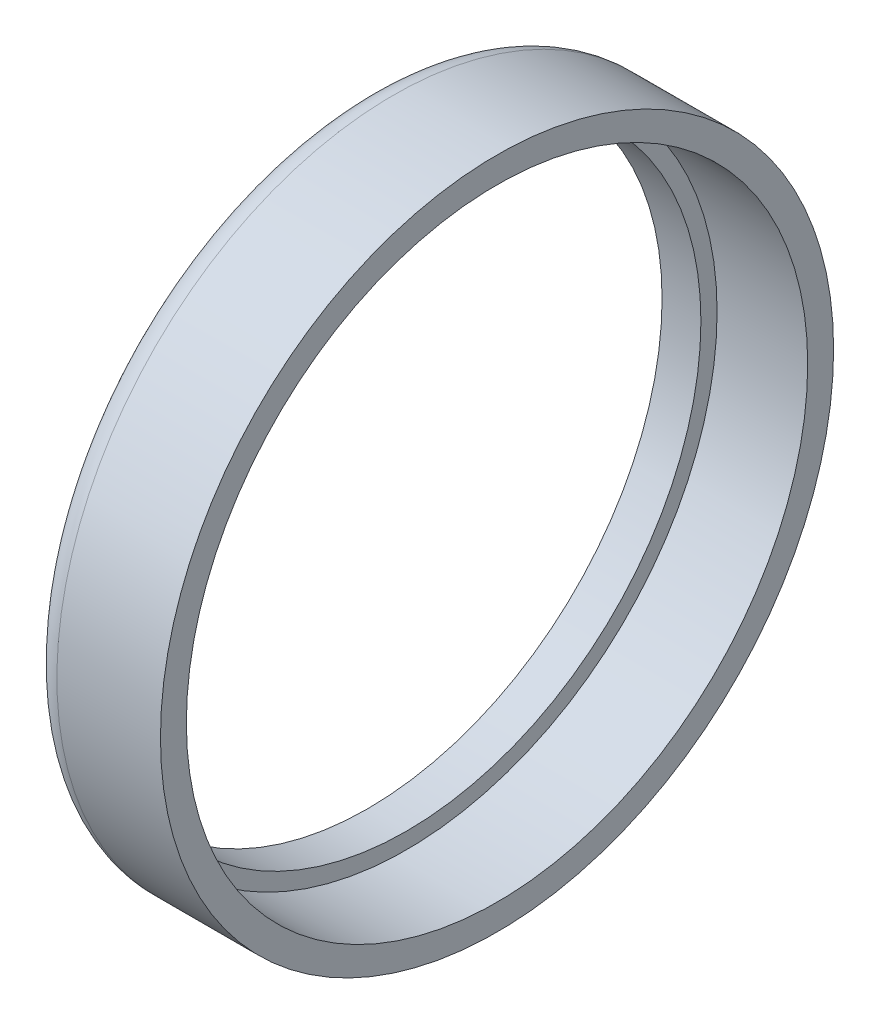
ISO-10303-21;
HEADER;
FILE_DESCRIPTION(('STEP AP214'),'2;1');
FILE_NAME('part.step','',(''),(''),'','','');
FILE_SCHEMA(('AUTOMOTIVE_DESIGN { 1 0 10303 214 1 1 1 1 }'));
ENDSEC;
DATA;
#1=APPLICATION_CONTEXT('core data for automotive mechanical design processes');
#2=APPLICATION_PROTOCOL_DEFINITION('international standard','automotive_design',2000,#1);
#3=PRODUCT_CONTEXT('',#1,'mechanical');
#4=PRODUCT('Part','Part','',(#3));
#5=PRODUCT_RELATED_PRODUCT_CATEGORY('part','',(#4));
#6=PRODUCT_DEFINITION_FORMATION('','',#4);
#7=PRODUCT_DEFINITION_CONTEXT('part definition',#1,'design');
#8=PRODUCT_DEFINITION('design','',#6,#7);
#9=PRODUCT_DEFINITION_SHAPE('','',#8);
#10=(LENGTH_UNIT() NAMED_UNIT(*) SI_UNIT(.MILLI.,.METRE.));
#11=(NAMED_UNIT(*) PLANE_ANGLE_UNIT() SI_UNIT($,.RADIAN.));
#12=(NAMED_UNIT(*) SI_UNIT($,.STERADIAN.) SOLID_ANGLE_UNIT());
#13=UNCERTAINTY_MEASURE_WITH_UNIT(LENGTH_MEASURE(1.E-05),#10,'distance_accuracy_value','');
#14=(GEOMETRIC_REPRESENTATION_CONTEXT(3) GLOBAL_UNCERTAINTY_ASSIGNED_CONTEXT((#13)) GLOBAL_UNIT_ASSIGNED_CONTEXT((#10,
#11,#12)) REPRESENTATION_CONTEXT('',''));
#15=CARTESIAN_POINT('',(0.,0.,0.));
#16=DIRECTION('',(0.,0.,1.));
#17=DIRECTION('',(1.,0.,0.));
#18=AXIS2_PLACEMENT_3D('',#15,#16,#17);
#19=CARTESIAN_POINT('',(-3.00000000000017,0.,0.));
#20=DIRECTION('',(1.,0.,0.));
#21=DIRECTION('',(0.,0.,-1.));
#22=AXIS2_PLACEMENT_3D('',#19,#20,#21);
#23=PLANE('',#22);
#24=CARTESIAN_POINT('',(-3.00000000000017,0.,0.));
#25=DIRECTION('',(1.,0.,0.));
#26=DIRECTION('',(0.,0.,-1.));
#27=AXIS2_PLACEMENT_3D('',#24,#25,#26);
#28=CIRCLE('',#27,22.75);
#29=CARTESIAN_POINT('',(-3.00000000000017,0.,-22.75));
#30=VERTEX_POINT('',#29);
#31=EDGE_CURVE('E38',#30,#30,#28,.T.);
#32=ORIENTED_EDGE('',*,*,#31,.T.);
#33=EDGE_LOOP('',(#32));
#34=FACE_BOUND('',#33,.T.);
#35=CARTESIAN_POINT('',(-3.,0.,0.));
#36=DIRECTION('',(1.,0.,0.));
#37=DIRECTION('',(0.,-1.,0.));
#38=AXIS2_PLACEMENT_3D('',#35,#36,#37);
#39=CIRCLE('',#38,23.99999999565);
#40=CARTESIAN_POINT('',(-3.,-23.99999999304,0.));
#41=VERTEX_POINT('',#40);
#42=CARTESIAN_POINT('',(-3.,23.99999999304,0.));
#43=VERTEX_POINT('',#42);
#44=EDGE_CURVE('E36',#41,#43,#39,.T.);
#45=ORIENTED_EDGE('',*,*,#44,.F.);
#46=CARTESIAN_POINT('',(-3.,0.,0.));
#47=DIRECTION('',(1.,0.,0.));
#48=DIRECTION('',(0.,1.,0.));
#49=AXIS2_PLACEMENT_3D('',#46,#47,#48);
#50=CIRCLE('',#49,23.9999999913);
#51=EDGE_CURVE('E32',#43,#41,#50,.T.);
#52=ORIENTED_EDGE('',*,*,#51,.F.);
#53=EDGE_LOOP('',(#45,#52));
#54=FACE_BOUND('',#53,.T.);
#55=ADVANCED_FACE('F14',(#34,#54),#23,.F.);
#56=CARTESIAN_POINT('',(-3.00000000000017,0.,0.));
#57=DIRECTION('',(1.,0.,0.));
#58=DIRECTION('',(0.,0.,-1.));
#59=AXIS2_PLACEMENT_3D('',#56,#57,#58);
#60=CYLINDRICAL_SURFACE('',#59,22.75);
#61=ORIENTED_EDGE('',*,*,#31,.F.);
#62=EDGE_LOOP('',(#61));
#63=FACE_BOUND('',#62,.T.);
#64=CARTESIAN_POINT('',(0.,0.,0.));
#65=DIRECTION('',(1.,0.,0.));
#66=DIRECTION('',(0.,0.,-1.));
#67=AXIS2_PLACEMENT_3D('',#64,#65,#66);
#68=CIRCLE('',#67,22.75);
#69=CARTESIAN_POINT('',(0.,0.,-22.75));
#70=VERTEX_POINT('',#69);
#71=EDGE_CURVE('E43',#70,#70,#68,.F.);
#72=ORIENTED_EDGE('',*,*,#71,.F.);
#73=EDGE_LOOP('',(#72));
#74=FACE_BOUND('',#73,.T.);
#75=ADVANCED_FACE('F61',(#63,#74),#60,.F.);
#76=CARTESIAN_POINT('',(-1.,0.,0.));
#77=DIRECTION('',(1.,0.,0.));
#78=DIRECTION('',(0.,0.999980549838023,0.00623698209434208));
#79=AXIS2_PLACEMENT_3D('',#76,#77,#78);
#80=TOROIDAL_SURFACE('',#79,24.,2.);
#81=CARTESIAN_POINT('',(-1.,0.,0.));
#82=DIRECTION('',(1.,0.,0.));
#83=DIRECTION('',(0.,-1.,0.));
#84=AXIS2_PLACEMENT_3D('',#81,#82,#83);
#85=CIRCLE('',#84,26.);
#86=CARTESIAN_POINT('',(-1.,-26.,0.));
#87=VERTEX_POINT('',#86);
#88=EDGE_CURVE('E46',#87,#87,#85,.T.);
#89=ORIENTED_EDGE('',*,*,#88,.F.);
#90=EDGE_LOOP('',(#89));
#91=FACE_BOUND('',#90,.T.);
#92=ORIENTED_EDGE('',*,*,#44,.T.);
#93=ORIENTED_EDGE('',*,*,#51,.T.);
#94=EDGE_LOOP('',(#92,#93));
#95=FACE_BOUND('',#94,.T.);
#96=ADVANCED_FACE('F42',(#91,#95),#80,.T.);
#97=CARTESIAN_POINT('',(0.,0.,0.));
#98=DIRECTION('',(1.,0.,0.));
#99=DIRECTION('',(0.,0.,-1.));
#100=AXIS2_PLACEMENT_3D('',#97,#98,#99);
#101=PLANE('',#100);
#102=ORIENTED_EDGE('',*,*,#71,.T.);
#103=EDGE_LOOP('',(#102));
#104=FACE_BOUND('',#103,.T.);
#105=CARTESIAN_POINT('',(0.,0.,0.));
#106=DIRECTION('',(1.,0.,0.));
#107=DIRECTION('',(0.,0.,-1.));
#108=AXIS2_PLACEMENT_3D('',#105,#106,#107);
#109=CIRCLE('',#108,24.);
#110=CARTESIAN_POINT('',(0.,0.,-24.));
#111=VERTEX_POINT('',#110);
#112=EDGE_CURVE('E104',#111,#111,#109,.T.);
#113=ORIENTED_EDGE('',*,*,#112,.T.);
#114=EDGE_LOOP('',(#113));
#115=FACE_BOUND('',#114,.T.);
#116=ADVANCED_FACE('F60',(#104,#115),#101,.T.);
#117=CARTESIAN_POINT('',(-1.,0.,0.));
#118=DIRECTION('',(1.,0.,0.));
#119=DIRECTION('',(0.,0.,-1.));
#120=AXIS2_PLACEMENT_3D('',#117,#118,#119);
#121=CYLINDRICAL_SURFACE('',#120,26.);
#122=CARTESIAN_POINT('',(6.99999999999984,0.,0.));
#123=DIRECTION('',(1.,0.,0.));
#124=DIRECTION('',(0.,0.,-1.));
#125=AXIS2_PLACEMENT_3D('',#122,#123,#124);
#126=CIRCLE('',#125,26.);
#127=CARTESIAN_POINT('',(6.99999999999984,0.,-26.));
#128=VERTEX_POINT('',#127);
#129=EDGE_CURVE('E26',#128,#128,#126,.T.);
#130=ORIENTED_EDGE('',*,*,#129,.F.);
#131=EDGE_LOOP('',(#130));
#132=FACE_BOUND('',#131,.T.);
#133=ORIENTED_EDGE('',*,*,#88,.T.);
#134=EDGE_LOOP('',(#133));
#135=FACE_BOUND('',#134,.T.);
#136=ADVANCED_FACE('F97',(#132,#135),#121,.T.);
#137=CARTESIAN_POINT('',(0.,0.,0.));
#138=DIRECTION('',(1.,0.,0.));
#139=DIRECTION('',(0.,0.,-1.));
#140=AXIS2_PLACEMENT_3D('',#137,#138,#139);
#141=CYLINDRICAL_SURFACE('',#140,24.);
#142=CARTESIAN_POINT('',(6.99999999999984,0.,0.));
#143=DIRECTION('',(1.,0.,0.));
#144=DIRECTION('',(0.,0.,-1.));
#145=AXIS2_PLACEMENT_3D('',#142,#143,#144);
#146=CIRCLE('',#145,24.);
#147=CARTESIAN_POINT('',(6.99999999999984,0.,-24.));
#148=VERTEX_POINT('',#147);
#149=EDGE_CURVE('E9',#148,#148,#146,.F.);
#150=ORIENTED_EDGE('',*,*,#149,.F.);
#151=EDGE_LOOP('',(#150));
#152=FACE_BOUND('',#151,.T.);
#153=ORIENTED_EDGE('',*,*,#112,.F.);
#154=EDGE_LOOP('',(#153));
#155=FACE_BOUND('',#154,.T.);
#156=ADVANCED_FACE('F92',(#152,#155),#141,.F.);
#157=CARTESIAN_POINT('',(6.99999999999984,0.,0.));
#158=DIRECTION('',(1.,0.,0.));
#159=DIRECTION('',(0.,0.,-1.));
#160=AXIS2_PLACEMENT_3D('',#157,#158,#159);
#161=PLANE('',#160);
#162=ORIENTED_EDGE('',*,*,#149,.T.);
#163=EDGE_LOOP('',(#162));
#164=FACE_BOUND('',#163,.T.);
#165=ORIENTED_EDGE('',*,*,#129,.T.);
#166=EDGE_LOOP('',(#165));
#167=FACE_BOUND('',#166,.T.);
#168=ADVANCED_FACE('F16',(#164,#167),#161,.T.);
#169=CLOSED_SHELL('',(#55,#75,#96,#116,#136,#156,#168));
#170=MANIFOLD_SOLID_BREP('B1',#169);
#171=ADVANCED_BREP_SHAPE_REPRESENTATION('',(#18,#170),#14);
#172=SHAPE_DEFINITION_REPRESENTATION(#9,#171);
ENDSEC;
END-ISO-10303-21;
